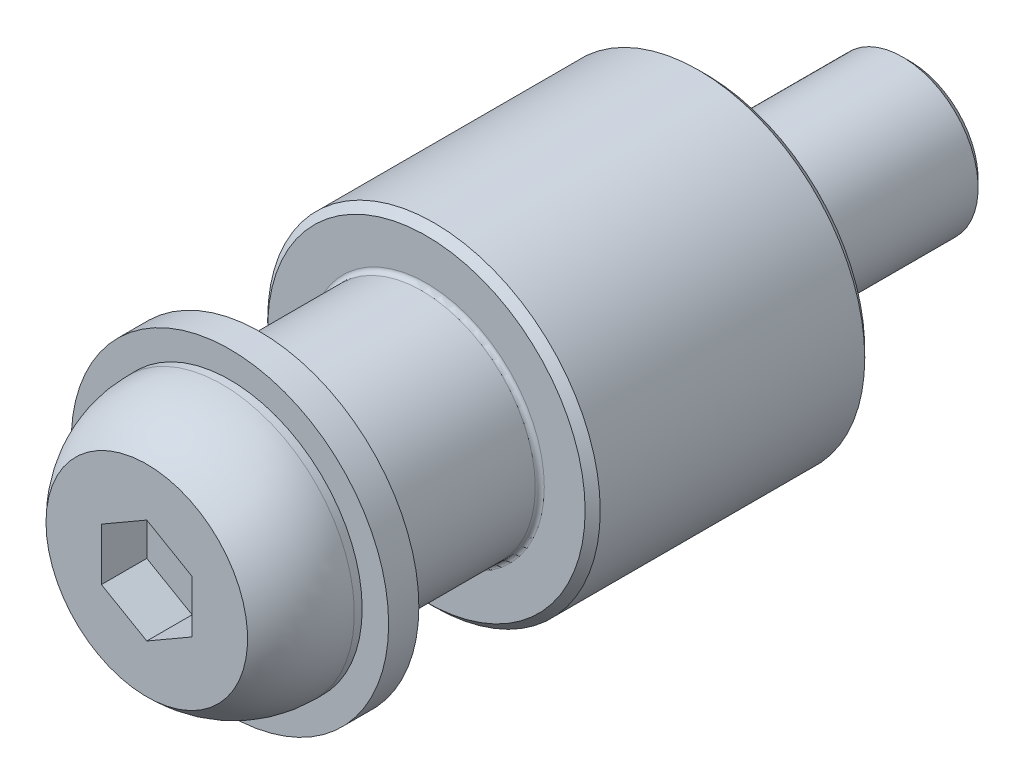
ISO-10303-21;
HEADER;
FILE_DESCRIPTION(('STEP AP214'),'2;1');
FILE_NAME('part.step','',(''),(''),'','','');
FILE_SCHEMA(('AUTOMOTIVE_DESIGN { 1 0 10303 214 1 1 1 1 }'));
ENDSEC;
DATA;
#1=APPLICATION_CONTEXT('core data for automotive mechanical design processes');
#2=APPLICATION_PROTOCOL_DEFINITION('international standard','automotive_design',2000,#1);
#3=PRODUCT_CONTEXT('',#1,'mechanical');
#4=PRODUCT('Part','Part','',(#3));
#5=PRODUCT_RELATED_PRODUCT_CATEGORY('part','',(#4));
#6=PRODUCT_DEFINITION_FORMATION('','',#4);
#7=PRODUCT_DEFINITION_CONTEXT('part definition',#1,'design');
#8=PRODUCT_DEFINITION('design','',#6,#7);
#9=PRODUCT_DEFINITION_SHAPE('','',#8);
#10=(LENGTH_UNIT() NAMED_UNIT(*) SI_UNIT(.MILLI.,.METRE.));
#11=(NAMED_UNIT(*) PLANE_ANGLE_UNIT() SI_UNIT($,.RADIAN.));
#12=(NAMED_UNIT(*) SI_UNIT($,.STERADIAN.) SOLID_ANGLE_UNIT());
#13=UNCERTAINTY_MEASURE_WITH_UNIT(LENGTH_MEASURE(1.E-05),#10,'distance_accuracy_value','');
#14=(GEOMETRIC_REPRESENTATION_CONTEXT(3) GLOBAL_UNCERTAINTY_ASSIGNED_CONTEXT((#13)) GLOBAL_UNIT_ASSIGNED_CONTEXT((#10,
#11,#12)) REPRESENTATION_CONTEXT('',''));
#15=CARTESIAN_POINT('',(0.,0.,0.));
#16=DIRECTION('',(0.,0.,1.));
#17=DIRECTION('',(1.,0.,0.));
#18=AXIS2_PLACEMENT_3D('',#15,#16,#17);
#19=CARTESIAN_POINT('',(0.,7.5,29.));
#20=DIRECTION('',(0.,0.,1.));
#21=DIRECTION('',(1.,0.,0.));
#22=AXIS2_PLACEMENT_3D('',#19,#20,#21);
#23=PLANE('',#22);
#24=CARTESIAN_POINT('',(0.,0.,29.));
#25=DIRECTION('',(0.,0.,1.));
#26=DIRECTION('',(1.,0.,0.));
#27=AXIS2_PLACEMENT_3D('',#24,#25,#26);
#28=CIRCLE('',#27,7.);
#29=CARTESIAN_POINT('',(7.,0.,29.));
#30=VERTEX_POINT('',#29);
#31=EDGE_CURVE('E184',#30,#30,#28,.T.);
#32=ORIENTED_EDGE('',*,*,#31,.T.);
#33=EDGE_LOOP('',(#32));
#34=FACE_BOUND('',#33,.T.);
#35=CARTESIAN_POINT('',(0.,0.,29.));
#36=DIRECTION('',(0.,0.,-1.));
#37=DIRECTION('',(-1.,0.,0.));
#38=AXIS2_PLACEMENT_3D('',#35,#36,#37);
#39=CIRCLE('',#38,5.);
#40=CARTESIAN_POINT('',(-5.,0.,29.));
#41=VERTEX_POINT('',#40);
#42=EDGE_CURVE('E162',#41,#41,#39,.T.);
#43=ORIENTED_EDGE('',*,*,#42,.T.);
#44=EDGE_LOOP('',(#43));
#45=FACE_BOUND('',#44,.T.);
#46=ADVANCED_FACE('F14',(#34,#45),#23,.T.);
#47=CARTESIAN_POINT('',(0.,0.,0.));
#48=DIRECTION('',(0.,0.,-1.));
#49=DIRECTION('',(-1.,0.,0.));
#50=AXIS2_PLACEMENT_3D('',#47,#48,#49);
#51=CYLINDRICAL_SURFACE('',#50,7.5);
#52=CARTESIAN_POINT('',(0.,0.,18.8));
#53=DIRECTION('',(0.,0.,1.));
#54=DIRECTION('',(1.,0.,0.));
#55=AXIS2_PLACEMENT_3D('',#52,#53,#54);
#56=CIRCLE('',#55,7.5);
#57=CARTESIAN_POINT('',(7.5,0.,18.8));
#58=VERTEX_POINT('',#57);
#59=EDGE_CURVE('E9',#58,#58,#56,.T.);
#60=ORIENTED_EDGE('',*,*,#59,.T.);
#61=EDGE_LOOP('',(#60));
#62=FACE_BOUND('',#61,.T.);
#63=CARTESIAN_POINT('',(0.,0.,28.5));
#64=DIRECTION('',(0.,0.,1.));
#65=DIRECTION('',(1.,0.,0.));
#66=AXIS2_PLACEMENT_3D('',#63,#64,#65);
#67=CIRCLE('',#66,7.5);
#68=CARTESIAN_POINT('',(7.5,0.,28.5));
#69=VERTEX_POINT('',#68);
#70=EDGE_CURVE('E181',#69,#69,#67,.F.);
#71=ORIENTED_EDGE('',*,*,#70,.T.);
#72=EDGE_LOOP('',(#71));
#73=FACE_BOUND('',#72,.T.);
#74=ADVANCED_FACE('F441',(#62,#73),#51,.T.);
#75=CARTESIAN_POINT('',(0.,11.,18.5));
#76=DIRECTION('',(0.,0.,1.));
#77=DIRECTION('',(1.,0.,0.));
#78=AXIS2_PLACEMENT_3D('',#75,#76,#77);
#79=PLANE('',#78);
#80=CARTESIAN_POINT('',(0.,0.,18.5));
#81=DIRECTION('',(0.,0.,1.));
#82=DIRECTION('',(1.,0.,0.));
#83=AXIS2_PLACEMENT_3D('',#80,#81,#82);
#84=CIRCLE('',#83,7.8);
#85=CARTESIAN_POINT('',(7.8,0.,18.5));
#86=VERTEX_POINT('',#85);
#87=EDGE_CURVE('E23',#86,#86,#84,.F.);
#88=ORIENTED_EDGE('',*,*,#87,.T.);
#89=EDGE_LOOP('',(#88));
#90=FACE_BOUND('',#89,.T.);
#91=CARTESIAN_POINT('',(0.,0.,18.5));
#92=DIRECTION('',(0.,0.,1.));
#93=DIRECTION('',(1.,0.,0.));
#94=AXIS2_PLACEMENT_3D('',#91,#92,#93);
#95=CIRCLE('',#94,10.5);
#96=CARTESIAN_POINT('',(10.5,0.,18.5));
#97=VERTEX_POINT('',#96);
#98=EDGE_CURVE('E178',#97,#97,#95,.T.);
#99=ORIENTED_EDGE('',*,*,#98,.T.);
#100=EDGE_LOOP('',(#99));
#101=FACE_BOUND('',#100,.T.);
#102=ADVANCED_FACE('F189',(#90,#101),#79,.T.);
#103=CARTESIAN_POINT('',(0.,0.,0.));
#104=DIRECTION('',(0.,0.,-1.));
#105=DIRECTION('',(-1.,0.,0.));
#106=AXIS2_PLACEMENT_3D('',#103,#104,#105);
#107=CYLINDRICAL_SURFACE('',#106,11.);
#108=CARTESIAN_POINT('',(0.,0.,0.5));
#109=DIRECTION('',(0.,0.,-1.));
#110=DIRECTION('',(-1.,0.,0.));
#111=AXIS2_PLACEMENT_3D('',#108,#109,#110);
#112=CIRCLE('',#111,11.);
#113=CARTESIAN_POINT('',(-11.,0.,0.5));
#114=VERTEX_POINT('',#113);
#115=EDGE_CURVE('E175',#114,#114,#112,.F.);
#116=ORIENTED_EDGE('',*,*,#115,.T.);
#117=EDGE_LOOP('',(#116));
#118=FACE_BOUND('',#117,.T.);
#119=CARTESIAN_POINT('',(0.,0.,18.));
#120=DIRECTION('',(0.,0.,1.));
#121=DIRECTION('',(1.,0.,0.));
#122=AXIS2_PLACEMENT_3D('',#119,#120,#121);
#123=CIRCLE('',#122,11.);
#124=CARTESIAN_POINT('',(11.,0.,18.));
#125=VERTEX_POINT('',#124);
#126=EDGE_CURVE('E172',#125,#125,#123,.F.);
#127=ORIENTED_EDGE('',*,*,#126,.T.);
#128=EDGE_LOOP('',(#127));
#129=FACE_BOUND('',#128,.T.);
#130=ADVANCED_FACE('F422',(#118,#129),#107,.T.);
#131=CARTESIAN_POINT('',(0.,0.,0.));
#132=DIRECTION('',(0.,0.,-1.));
#133=DIRECTION('',(-1.,0.,0.));
#134=AXIS2_PLACEMENT_3D('',#131,#132,#133);
#135=PLANE('',#134);
#136=CARTESIAN_POINT('',(0.,0.,0.));
#137=DIRECTION('',(0.,0.,-1.));
#138=DIRECTION('',(-1.,0.,0.));
#139=AXIS2_PLACEMENT_3D('',#136,#137,#138);
#140=CIRCLE('',#139,10.5);
#141=CARTESIAN_POINT('',(-10.5,0.,0.));
#142=VERTEX_POINT('',#141);
#143=EDGE_CURVE('E167',#142,#142,#140,.T.);
#144=ORIENTED_EDGE('',*,*,#143,.T.);
#145=EDGE_LOOP('',(#144));
#146=FACE_BOUND('',#145,.T.);
#147=CARTESIAN_POINT('',(0.,0.,0.));
#148=DIRECTION('',(0.,0.,-1.));
#149=DIRECTION('',(-1.,0.,0.));
#150=AXIS2_PLACEMENT_3D('',#147,#148,#149);
#151=CIRCLE('',#150,5.);
#152=CARTESIAN_POINT('',(-5.,0.,0.));
#153=VERTEX_POINT('',#152);
#154=EDGE_CURVE('E158',#153,#153,#151,.T.);
#155=ORIENTED_EDGE('',*,*,#154,.F.);
#156=EDGE_LOOP('',(#155));
#157=FACE_BOUND('',#156,.T.);
#158=ADVANCED_FACE('F412',(#146,#157),#135,.T.);
#159=CARTESIAN_POINT('',(0.,0.,0.));
#160=DIRECTION('',(0.,0.,1.));
#161=DIRECTION('',(1.,0.,0.));
#162=AXIS2_PLACEMENT_3D('',#159,#160,#161);
#163=CONICAL_SURFACE('',#162,10.5,0.785398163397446);
#164=ORIENTED_EDGE('',*,*,#115,.F.);
#165=EDGE_LOOP('',(#164));
#166=FACE_BOUND('',#165,.T.);
#167=ORIENTED_EDGE('',*,*,#143,.F.);
#168=EDGE_LOOP('',(#167));
#169=FACE_BOUND('',#168,.T.);
#170=ADVANCED_FACE('F401',(#166,#169),#163,.T.);
#171=CARTESIAN_POINT('',(0.,0.,18.));
#172=DIRECTION('',(0.,0.,-1.));
#173=DIRECTION('',(-1.,0.,0.));
#174=AXIS2_PLACEMENT_3D('',#171,#172,#173);
#175=CONICAL_SURFACE('',#174,11.,0.785398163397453);
#176=ORIENTED_EDGE('',*,*,#98,.F.);
#177=EDGE_LOOP('',(#176));
#178=FACE_BOUND('',#177,.T.);
#179=ORIENTED_EDGE('',*,*,#126,.F.);
#180=EDGE_LOOP('',(#179));
#181=FACE_BOUND('',#180,.T.);
#182=ADVANCED_FACE('F207',(#178,#181),#175,.T.);
#183=CARTESIAN_POINT('',(0.,0.,28.5));
#184=DIRECTION('',(0.,0.,-1.));
#185=DIRECTION('',(-1.,0.,0.));
#186=AXIS2_PLACEMENT_3D('',#183,#184,#185);
#187=CONICAL_SURFACE('',#186,7.5,0.78539816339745);
#188=ORIENTED_EDGE('',*,*,#31,.F.);
#189=EDGE_LOOP('',(#188));
#190=FACE_BOUND('',#189,.T.);
#191=ORIENTED_EDGE('',*,*,#70,.F.);
#192=EDGE_LOOP('',(#191));
#193=FACE_BOUND('',#192,.T.);
#194=ADVANCED_FACE('F195',(#190,#193),#187,.T.);
#195=CARTESIAN_POINT('',(0.,0.,18.8));
#196=DIRECTION('',(0.,0.,1.));
#197=DIRECTION('',(1.,0.,0.));
#198=AXIS2_PLACEMENT_3D('',#195,#196,#197);
#199=TOROIDAL_SURFACE('',#198,7.8,0.3);
#200=ORIENTED_EDGE('',*,*,#59,.F.);
#201=EDGE_LOOP('',(#200));
#202=FACE_BOUND('',#201,.T.);
#203=ORIENTED_EDGE('',*,*,#87,.F.);
#204=EDGE_LOOP('',(#203));
#205=FACE_BOUND('',#204,.T.);
#206=ADVANCED_FACE('F192',(#202,#205),#199,.F.);
#207=CARTESIAN_POINT('',(5.,0.,-13.5));
#208=DIRECTION('',(0.,0.,1.));
#209=DIRECTION('',(-1.,0.,0.));
#210=AXIS2_PLACEMENT_3D('',#207,#208,#209);
#211=PLANE('',#210);
#212=CARTESIAN_POINT('',(0.,0.,-13.5));
#213=DIRECTION('',(0.,0.,1.));
#214=DIRECTION('',(-1.,0.,0.));
#215=AXIS2_PLACEMENT_3D('',#212,#213,#214);
#216=CIRCLE('',#215,4.5);
#217=CARTESIAN_POINT('',(-4.50000000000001,0.,-13.5));
#218=VERTEX_POINT('',#217);
#219=EDGE_CURVE('E18',#218,#218,#216,.F.);
#220=ORIENTED_EDGE('',*,*,#219,.T.);
#221=EDGE_LOOP('',(#220));
#222=FACE_BOUND('',#221,.T.);
#223=ADVANCED_FACE('F194',(#222),#211,.F.);
#224=CARTESIAN_POINT('',(0.,0.,-13.));
#225=DIRECTION('',(0.,0.,1.));
#226=DIRECTION('',(-1.,0.,0.));
#227=AXIS2_PLACEMENT_3D('',#224,#225,#226);
#228=CONICAL_SURFACE('',#227,5.,0.785398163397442);
#229=ORIENTED_EDGE('',*,*,#219,.F.);
#230=EDGE_LOOP('',(#229));
#231=FACE_BOUND('',#230,.T.);
#232=CARTESIAN_POINT('',(0.,0.,-13.));
#233=DIRECTION('',(0.,0.,1.));
#234=DIRECTION('',(-1.,0.,0.));
#235=AXIS2_PLACEMENT_3D('',#232,#233,#234);
#236=CIRCLE('',#235,5.);
#237=CARTESIAN_POINT('',(-5.00000000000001,0.,-13.));
#238=VERTEX_POINT('',#237);
#239=EDGE_CURVE('E133',#238,#238,#236,.T.);
#240=ORIENTED_EDGE('',*,*,#239,.F.);
#241=EDGE_LOOP('',(#240));
#242=FACE_BOUND('',#241,.T.);
#243=ADVANCED_FACE('F205',(#231,#242),#228,.T.);
#244=CARTESIAN_POINT('',(0.,0.,37.));
#245=DIRECTION('',(0.,0.,1.));
#246=DIRECTION('',(-1.,0.,0.));
#247=AXIS2_PLACEMENT_3D('',#244,#245,#246);
#248=CYLINDRICAL_SURFACE('',#247,5.);
#249=ORIENTED_EDGE('',*,*,#239,.T.);
#250=EDGE_LOOP('',(#249));
#251=FACE_BOUND('',#250,.T.);
#252=ORIENTED_EDGE('',*,*,#154,.T.);
#253=EDGE_LOOP('',(#252));
#254=FACE_BOUND('',#253,.T.);
#255=ADVANCED_FACE('F234',(#251,#254),#248,.T.);
#256=CARTESIAN_POINT('',(3.,-5.19615242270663,34.));
#257=DIRECTION('',(0.,0.,1.));
#258=DIRECTION('',(-1.,0.,0.));
#259=AXIS2_PLACEMENT_3D('',#256,#257,#258);
#260=PLANE('',#259);
#261=DIRECTION('',(0.866025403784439,-0.5,0.));
#262=VECTOR('',#261,1.);
#263=CARTESIAN_POINT('',(-3.,-1.73205080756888,34.));
#264=LINE('',#263,#262);
#265=CARTESIAN_POINT('',(-3.,-1.73205080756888,34.));
#266=VERTEX_POINT('',#265);
#267=CARTESIAN_POINT('',(0.,-3.46410161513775,34.));
#268=VERTEX_POINT('',#267);
#269=EDGE_CURVE('E103',#266,#268,#264,.T.);
#270=ORIENTED_EDGE('',*,*,#269,.T.);
#271=DIRECTION('',(0.866025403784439,0.5,0.));
#272=VECTOR('',#271,1.);
#273=CARTESIAN_POINT('',(0.,-3.46410161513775,34.));
#274=LINE('',#273,#272);
#275=CARTESIAN_POINT('',(3.,-1.73205080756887,34.));
#276=VERTEX_POINT('',#275);
#277=EDGE_CURVE('E106',#268,#276,#274,.T.);
#278=ORIENTED_EDGE('',*,*,#277,.T.);
#279=DIRECTION('',(0.,1.,0.));
#280=VECTOR('',#279,1.);
#281=CARTESIAN_POINT('',(3.,-1.73205080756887,34.));
#282=LINE('',#281,#280);
#283=CARTESIAN_POINT('',(3.,1.73205080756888,34.));
#284=VERTEX_POINT('',#283);
#285=EDGE_CURVE('E77',#276,#284,#282,.T.);
#286=ORIENTED_EDGE('',*,*,#285,.T.);
#287=DIRECTION('',(-0.866025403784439,0.5,0.));
#288=VECTOR('',#287,1.);
#289=CARTESIAN_POINT('',(3.,1.73205080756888,34.));
#290=LINE('',#289,#288);
#291=CARTESIAN_POINT('',(0.,3.46410161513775,34.));
#292=VERTEX_POINT('',#291);
#293=EDGE_CURVE('E109',#284,#292,#290,.T.);
#294=ORIENTED_EDGE('',*,*,#293,.T.);
#295=DIRECTION('',(-0.866025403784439,-0.5,0.));
#296=VECTOR('',#295,1.);
#297=CARTESIAN_POINT('',(0.,3.46410161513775,34.));
#298=LINE('',#297,#296);
#299=CARTESIAN_POINT('',(-3.,1.73205080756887,34.));
#300=VERTEX_POINT('',#299);
#301=EDGE_CURVE('E112',#292,#300,#298,.T.);
#302=ORIENTED_EDGE('',*,*,#301,.T.);
#303=DIRECTION('',(0.,-1.,0.));
#304=VECTOR('',#303,1.);
#305=CARTESIAN_POINT('',(-3.,1.73205080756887,34.));
#306=LINE('',#305,#304);
#307=EDGE_CURVE('E115',#300,#266,#306,.T.);
#308=ORIENTED_EDGE('',*,*,#307,.T.);
#309=EDGE_LOOP('',(#270,#278,#286,#294,#302,#308));
#310=FACE_BOUND('',#309,.T.);
#311=ADVANCED_FACE('F231',(#310),#260,.T.);
#312=CARTESIAN_POINT('',(3.,-1.73205080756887,34.));
#313=DIRECTION('',(1.,0.,0.));
#314=DIRECTION('',(0.,1.,0.));
#315=AXIS2_PLACEMENT_3D('',#312,#313,#314);
#316=PLANE('',#315);
#317=DIRECTION('',(0.,1.,0.));
#318=VECTOR('',#317,1.);
#319=CARTESIAN_POINT('',(3.,-1.73205080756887,37.));
#320=LINE('',#319,#318);
#321=CARTESIAN_POINT('',(3.,-1.73205080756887,37.));
#322=VERTEX_POINT('',#321);
#323=CARTESIAN_POINT('',(3.,1.73205080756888,37.));
#324=VERTEX_POINT('',#323);
#325=EDGE_CURVE('E74',#322,#324,#320,.T.);
#326=ORIENTED_EDGE('',*,*,#325,.T.);
#327=DIRECTION('',(0.,0.,1.));
#328=VECTOR('',#327,1.);
#329=CARTESIAN_POINT('',(3.,1.73205080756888,34.));
#330=LINE('',#329,#328);
#331=EDGE_CURVE('E81',#284,#324,#330,.T.);
#332=ORIENTED_EDGE('',*,*,#331,.F.);
#333=ORIENTED_EDGE('',*,*,#285,.F.);
#334=DIRECTION('',(0.,0.,1.));
#335=VECTOR('',#334,1.);
#336=CARTESIAN_POINT('',(3.,-1.73205080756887,34.));
#337=LINE('',#336,#335);
#338=EDGE_CURVE('E70',#276,#322,#337,.T.);
#339=ORIENTED_EDGE('',*,*,#338,.T.);
#340=EDGE_LOOP('',(#326,#332,#333,#339));
#341=FACE_BOUND('',#340,.T.);
#342=ADVANCED_FACE('F72',(#341),#316,.F.);
#343=CARTESIAN_POINT('',(3.,1.73205080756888,34.));
#344=DIRECTION('',(0.5,0.866025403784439,0.));
#345=DIRECTION('',(-0.866025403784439,0.5,0.));
#346=AXIS2_PLACEMENT_3D('',#343,#344,#345);
#347=PLANE('',#346);
#348=DIRECTION('',(-0.866025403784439,0.5,0.));
#349=VECTOR('',#348,1.);
#350=CARTESIAN_POINT('',(3.,1.73205080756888,37.));
#351=LINE('',#350,#349);
#352=CARTESIAN_POINT('',(0.,3.46410161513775,37.));
#353=VERTEX_POINT('',#352);
#354=EDGE_CURVE('E93',#324,#353,#351,.T.);
#355=ORIENTED_EDGE('',*,*,#354,.T.);
#356=DIRECTION('',(0.,0.,1.));
#357=VECTOR('',#356,1.);
#358=CARTESIAN_POINT('',(0.,3.46410161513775,34.));
#359=LINE('',#358,#357);
#360=EDGE_CURVE('E122',#292,#353,#359,.T.);
#361=ORIENTED_EDGE('',*,*,#360,.F.);
#362=ORIENTED_EDGE('',*,*,#293,.F.);
#363=ORIENTED_EDGE('',*,*,#331,.T.);
#364=EDGE_LOOP('',(#355,#361,#362,#363));
#365=FACE_BOUND('',#364,.T.);
#366=ADVANCED_FACE('F243',(#365),#347,.F.);
#367=CARTESIAN_POINT('',(0.,3.46410161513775,34.));
#368=DIRECTION('',(-0.5,0.866025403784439,0.));
#369=DIRECTION('',(-0.866025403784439,-0.5,0.));
#370=AXIS2_PLACEMENT_3D('',#367,#368,#369);
#371=PLANE('',#370);
#372=DIRECTION('',(-0.866025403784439,-0.5,0.));
#373=VECTOR('',#372,1.);
#374=CARTESIAN_POINT('',(0.,3.46410161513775,37.));
#375=LINE('',#374,#373);
#376=CARTESIAN_POINT('',(-3.,1.73205080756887,37.));
#377=VERTEX_POINT('',#376);
#378=EDGE_CURVE('E95',#353,#377,#375,.T.);
#379=ORIENTED_EDGE('',*,*,#378,.T.);
#380=DIRECTION('',(0.,0.,1.));
#381=VECTOR('',#380,1.);
#382=CARTESIAN_POINT('',(-3.,1.73205080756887,34.));
#383=LINE('',#382,#381);
#384=EDGE_CURVE('E120',#300,#377,#383,.T.);
#385=ORIENTED_EDGE('',*,*,#384,.F.);
#386=ORIENTED_EDGE('',*,*,#301,.F.);
#387=ORIENTED_EDGE('',*,*,#360,.T.);
#388=EDGE_LOOP('',(#379,#385,#386,#387));
#389=FACE_BOUND('',#388,.T.);
#390=ADVANCED_FACE('F240',(#389),#371,.F.);
#391=CARTESIAN_POINT('',(-3.,1.73205080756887,34.));
#392=DIRECTION('',(-1.,0.,0.));
#393=DIRECTION('',(0.,-1.,0.));
#394=AXIS2_PLACEMENT_3D('',#391,#392,#393);
#395=PLANE('',#394);
#396=DIRECTION('',(0.,-1.,0.));
#397=VECTOR('',#396,1.);
#398=CARTESIAN_POINT('',(-3.,1.73205080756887,37.));
#399=LINE('',#398,#397);
#400=CARTESIAN_POINT('',(-3.,-1.73205080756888,37.));
#401=VERTEX_POINT('',#400);
#402=EDGE_CURVE('E101',#377,#401,#399,.T.);
#403=ORIENTED_EDGE('',*,*,#402,.T.);
#404=DIRECTION('',(0.,0.,1.));
#405=VECTOR('',#404,1.);
#406=CARTESIAN_POINT('',(-3.,-1.73205080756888,34.));
#407=LINE('',#406,#405);
#408=EDGE_CURVE('E38',#266,#401,#407,.T.);
#409=ORIENTED_EDGE('',*,*,#408,.F.);
#410=ORIENTED_EDGE('',*,*,#307,.F.);
#411=ORIENTED_EDGE('',*,*,#384,.T.);
#412=EDGE_LOOP('',(#403,#409,#410,#411));
#413=FACE_BOUND('',#412,.T.);
#414=ADVANCED_FACE('F236',(#413),#395,.F.);
#415=CARTESIAN_POINT('',(-3.,-1.73205080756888,34.));
#416=DIRECTION('',(-0.5,-0.866025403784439,0.));
#417=DIRECTION('',(0.866025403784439,-0.5,0.));
#418=AXIS2_PLACEMENT_3D('',#415,#416,#417);
#419=PLANE('',#418);
#420=DIRECTION('',(0.866025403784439,-0.5,0.));
#421=VECTOR('',#420,1.);
#422=CARTESIAN_POINT('',(-3.,-1.73205080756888,37.));
#423=LINE('',#422,#421);
#424=CARTESIAN_POINT('',(0.,-3.46410161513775,37.));
#425=VERTEX_POINT('',#424);
#426=EDGE_CURVE('E31',#401,#425,#423,.T.);
#427=ORIENTED_EDGE('',*,*,#426,.T.);
#428=DIRECTION('',(0.,0.,1.));
#429=VECTOR('',#428,1.);
#430=CARTESIAN_POINT('',(0.,-3.46410161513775,34.));
#431=LINE('',#430,#429);
#432=EDGE_CURVE('E82',#268,#425,#431,.T.);
#433=ORIENTED_EDGE('',*,*,#432,.F.);
#434=ORIENTED_EDGE('',*,*,#269,.F.);
#435=ORIENTED_EDGE('',*,*,#408,.T.);
#436=EDGE_LOOP('',(#427,#433,#434,#435));
#437=FACE_BOUND('',#436,.T.);
#438=ADVANCED_FACE('F239',(#437),#419,.F.);
#439=CARTESIAN_POINT('',(0.,-3.46410161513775,34.));
#440=DIRECTION('',(0.5,-0.866025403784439,0.));
#441=DIRECTION('',(0.866025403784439,0.5,0.));
#442=AXIS2_PLACEMENT_3D('',#439,#440,#441);
#443=PLANE('',#442);
#444=DIRECTION('',(0.866025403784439,0.5,0.));
#445=VECTOR('',#444,1.);
#446=CARTESIAN_POINT('',(0.,-3.46410161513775,37.));
#447=LINE('',#446,#445);
#448=EDGE_CURVE('E85',#425,#322,#447,.T.);
#449=ORIENTED_EDGE('',*,*,#448,.T.);
#450=ORIENTED_EDGE('',*,*,#338,.F.);
#451=ORIENTED_EDGE('',*,*,#277,.F.);
#452=ORIENTED_EDGE('',*,*,#432,.T.);
#453=EDGE_LOOP('',(#449,#450,#451,#452));
#454=FACE_BOUND('',#453,.T.);
#455=ADVANCED_FACE('F86',(#454),#443,.F.);
#456=CARTESIAN_POINT('',(0.,0.,37.));
#457=DIRECTION('',(0.,0.,-1.));
#458=DIRECTION('',(1.,0.,0.));
#459=AXIS2_PLACEMENT_3D('',#456,#457,#458);
#460=PLANE('',#459);
#461=ORIENTED_EDGE('',*,*,#448,.F.);
#462=ORIENTED_EDGE('',*,*,#426,.F.);
#463=ORIENTED_EDGE('',*,*,#402,.F.);
#464=ORIENTED_EDGE('',*,*,#378,.F.);
#465=ORIENTED_EDGE('',*,*,#354,.F.);
#466=ORIENTED_EDGE('',*,*,#325,.F.);
#467=EDGE_LOOP('',(#461,#462,#463,#464,#465,#466));
#468=FACE_BOUND('',#467,.T.);
#469=CARTESIAN_POINT('',(0.,0.,37.));
#470=DIRECTION('',(0.,0.,1.));
#471=DIRECTION('',(-1.,0.,0.));
#472=AXIS2_PLACEMENT_3D('',#469,#470,#471);
#473=CIRCLE('',#472,6.66774468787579);
#474=CARTESIAN_POINT('',(-6.66774468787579,0.,37.));
#475=VERTEX_POINT('',#474);
#476=EDGE_CURVE('E128',#475,#475,#473,.T.);
#477=ORIENTED_EDGE('',*,*,#476,.T.);
#478=EDGE_LOOP('',(#477));
#479=FACE_BOUND('',#478,.T.);
#480=ADVANCED_FACE('F89',(#468,#479),#460,.F.);
#481=CARTESIAN_POINT('',(0.,0.,32.0184553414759));
#482=DIRECTION('',(0.,0.,1.));
#483=DIRECTION('',(-1.,0.,0.));
#484=AXIS2_PLACEMENT_3D('',#481,#482,#483);
#485=DEGENERATE_TOROIDAL_SURFACE('',#484,1.75,7.,.T.);
#486=ORIENTED_EDGE('',*,*,#476,.F.);
#487=EDGE_LOOP('',(#486));
#488=FACE_BOUND('',#487,.T.);
#489=CARTESIAN_POINT('',(0.,0.,32.0184553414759));
#490=DIRECTION('',(0.,0.,1.));
#491=DIRECTION('',(-1.,0.,0.));
#492=AXIS2_PLACEMENT_3D('',#489,#490,#491);
#493=CIRCLE('',#492,8.75);
#494=CARTESIAN_POINT('',(-8.75,0.,32.0184553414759));
#495=VERTEX_POINT('',#494);
#496=EDGE_CURVE('E131',#495,#495,#493,.T.);
#497=ORIENTED_EDGE('',*,*,#496,.T.);
#498=EDGE_LOOP('',(#497));
#499=FACE_BOUND('',#498,.T.);
#500=ADVANCED_FACE('F263',(#488,#499),#485,.T.);
#501=CARTESIAN_POINT('',(0.,0.,37.));
#502=DIRECTION('',(0.,0.,1.));
#503=DIRECTION('',(-1.,0.,0.));
#504=AXIS2_PLACEMENT_3D('',#501,#502,#503);
#505=CYLINDRICAL_SURFACE('',#504,8.75);
#506=ORIENTED_EDGE('',*,*,#496,.F.);
#507=EDGE_LOOP('',(#506));
#508=FACE_BOUND('',#507,.T.);
#509=CARTESIAN_POINT('',(0.,0.,31.5));
#510=DIRECTION('',(0.,0.,1.));
#511=DIRECTION('',(1.,0.,0.));
#512=AXIS2_PLACEMENT_3D('',#509,#510,#511);
#513=CIRCLE('',#512,8.75);
#514=CARTESIAN_POINT('',(8.75,0.,31.5));
#515=VERTEX_POINT('',#514);
#516=EDGE_CURVE('E156',#515,#515,#513,.F.);
#517=ORIENTED_EDGE('',*,*,#516,.F.);
#518=EDGE_LOOP('',(#517));
#519=FACE_BOUND('',#518,.T.);
#520=ADVANCED_FACE('F225',(#508,#519),#505,.T.);
#521=CARTESIAN_POINT('',(0.,0.,31.5));
#522=DIRECTION('',(0.,0.,1.));
#523=DIRECTION('',(1.,0.,0.));
#524=AXIS2_PLACEMENT_3D('',#521,#522,#523);
#525=PLANE('',#524);
#526=CARTESIAN_POINT('',(0.,0.,31.5));
#527=DIRECTION('',(0.,0.,1.));
#528=DIRECTION('',(1.,0.,0.));
#529=AXIS2_PLACEMENT_3D('',#526,#527,#528);
#530=CIRCLE('',#529,10.5);
#531=CARTESIAN_POINT('',(10.5,0.,31.5));
#532=VERTEX_POINT('',#531);
#533=EDGE_CURVE('E153',#532,#532,#530,.T.);
#534=ORIENTED_EDGE('',*,*,#533,.T.);
#535=EDGE_LOOP('',(#534));
#536=FACE_BOUND('',#535,.T.);
#537=ORIENTED_EDGE('',*,*,#516,.T.);
#538=EDGE_LOOP('',(#537));
#539=FACE_BOUND('',#538,.T.);
#540=ADVANCED_FACE('F214',(#536,#539),#525,.T.);
#541=CARTESIAN_POINT('',(0.,0.,31.5));
#542=DIRECTION('',(0.,0.,-1.));
#543=DIRECTION('',(-1.,0.,0.));
#544=AXIS2_PLACEMENT_3D('',#541,#542,#543);
#545=CYLINDRICAL_SURFACE('',#544,10.5);
#546=ORIENTED_EDGE('',*,*,#533,.F.);
#547=EDGE_LOOP('',(#546));
#548=FACE_BOUND('',#547,.T.);
#549=CARTESIAN_POINT('',(0.,0.,29.5));
#550=DIRECTION('',(0.,0.,1.));
#551=DIRECTION('',(1.,0.,0.));
#552=AXIS2_PLACEMENT_3D('',#549,#550,#551);
#553=CIRCLE('',#552,10.5);
#554=CARTESIAN_POINT('',(10.5,0.,29.5));
#555=VERTEX_POINT('',#554);
#556=EDGE_CURVE('E147',#555,#555,#553,.T.);
#557=ORIENTED_EDGE('',*,*,#556,.T.);
#558=EDGE_LOOP('',(#557));
#559=FACE_BOUND('',#558,.T.);
#560=ADVANCED_FACE('F198',(#548,#559),#545,.T.);
#561=CARTESIAN_POINT('',(0.,0.,29.5));
#562=DIRECTION('',(0.,0.,1.));
#563=DIRECTION('',(1.,0.,0.));
#564=AXIS2_PLACEMENT_3D('',#561,#562,#563);
#565=PLANE('',#564);
#566=ORIENTED_EDGE('',*,*,#556,.F.);
#567=EDGE_LOOP('',(#566));
#568=FACE_BOUND('',#567,.T.);
#569=CARTESIAN_POINT('',(0.,0.,29.5));
#570=DIRECTION('',(0.,0.,1.));
#571=DIRECTION('',(1.,0.,0.));
#572=AXIS2_PLACEMENT_3D('',#569,#570,#571);
#573=CIRCLE('',#572,5.25);
#574=CARTESIAN_POINT('',(5.25,0.,29.5));
#575=VERTEX_POINT('',#574);
#576=EDGE_CURVE('E138',#575,#575,#573,.T.);
#577=ORIENTED_EDGE('',*,*,#576,.T.);
#578=EDGE_LOOP('',(#577));
#579=FACE_BOUND('',#578,.T.);
#580=ADVANCED_FACE('F213',(#568,#579),#565,.F.);
#581=CARTESIAN_POINT('',(0.,0.,31.5));
#582=DIRECTION('',(0.,0.,-1.));
#583=DIRECTION('',(-1.,0.,0.));
#584=AXIS2_PLACEMENT_3D('',#581,#582,#583);
#585=CYLINDRICAL_SURFACE('',#584,5.25);
#586=CARTESIAN_POINT('',(0.,0.,31.5));
#587=DIRECTION('',(0.,0.,1.));
#588=DIRECTION('',(1.,0.,0.));
#589=AXIS2_PLACEMENT_3D('',#586,#587,#588);
#590=CIRCLE('',#589,5.25);
#591=CARTESIAN_POINT('',(5.25,0.,31.5));
#592=VERTEX_POINT('',#591);
#593=EDGE_CURVE('E142',#592,#592,#590,.T.);
#594=ORIENTED_EDGE('',*,*,#593,.T.);
#595=EDGE_LOOP('',(#594));
#596=FACE_BOUND('',#595,.T.);
#597=ORIENTED_EDGE('',*,*,#576,.F.);
#598=EDGE_LOOP('',(#597));
#599=FACE_BOUND('',#598,.T.);
#600=ADVANCED_FACE('F222',(#596,#599),#585,.F.);
#601=CARTESIAN_POINT('',(5.,0.,31.5));
#602=DIRECTION('',(0.,0.,1.));
#603=DIRECTION('',(-1.,0.,0.));
#604=AXIS2_PLACEMENT_3D('',#601,#602,#603);
#605=PLANE('',#604);
#606=ORIENTED_EDGE('',*,*,#593,.F.);
#607=EDGE_LOOP('',(#606));
#608=FACE_BOUND('',#607,.T.);
#609=CARTESIAN_POINT('',(0.,0.,31.5));
#610=DIRECTION('',(0.,0.,1.));
#611=DIRECTION('',(-1.,0.,0.));
#612=AXIS2_PLACEMENT_3D('',#609,#610,#611);
#613=CIRCLE('',#612,5.);
#614=CARTESIAN_POINT('',(-5.,0.,31.5));
#615=VERTEX_POINT('',#614);
#616=EDGE_CURVE('E119',#615,#615,#613,.T.);
#617=ORIENTED_EDGE('',*,*,#616,.T.);
#618=EDGE_LOOP('',(#617));
#619=FACE_BOUND('',#618,.T.);
#620=ADVANCED_FACE('F16',(#608,#619),#605,.F.);
#621=ORIENTED_EDGE('',*,*,#42,.F.);
#622=EDGE_LOOP('',(#621));
#623=FACE_BOUND('',#622,.T.);
#624=ORIENTED_EDGE('',*,*,#616,.F.);
#625=EDGE_LOOP('',(#624));
#626=FACE_BOUND('',#625,.T.);
#627=ADVANCED_FACE('F257',(#623,#626),#248,.T.);
#628=CLOSED_SHELL('',(#46,#74,#102,#130,#158,#170,#182,#194,#206,#223,#243,#255,#311,#342,#366,
#390,#414,#438,#455,#480,#500,#520,#540,#560,#580,#600,#620,#627));
#629=MANIFOLD_SOLID_BREP('B1',#628);
#630=ADVANCED_BREP_SHAPE_REPRESENTATION('',(#18,#629),#14);
#631=SHAPE_DEFINITION_REPRESENTATION(#9,#630);
ENDSEC;
END-ISO-10303-21;
